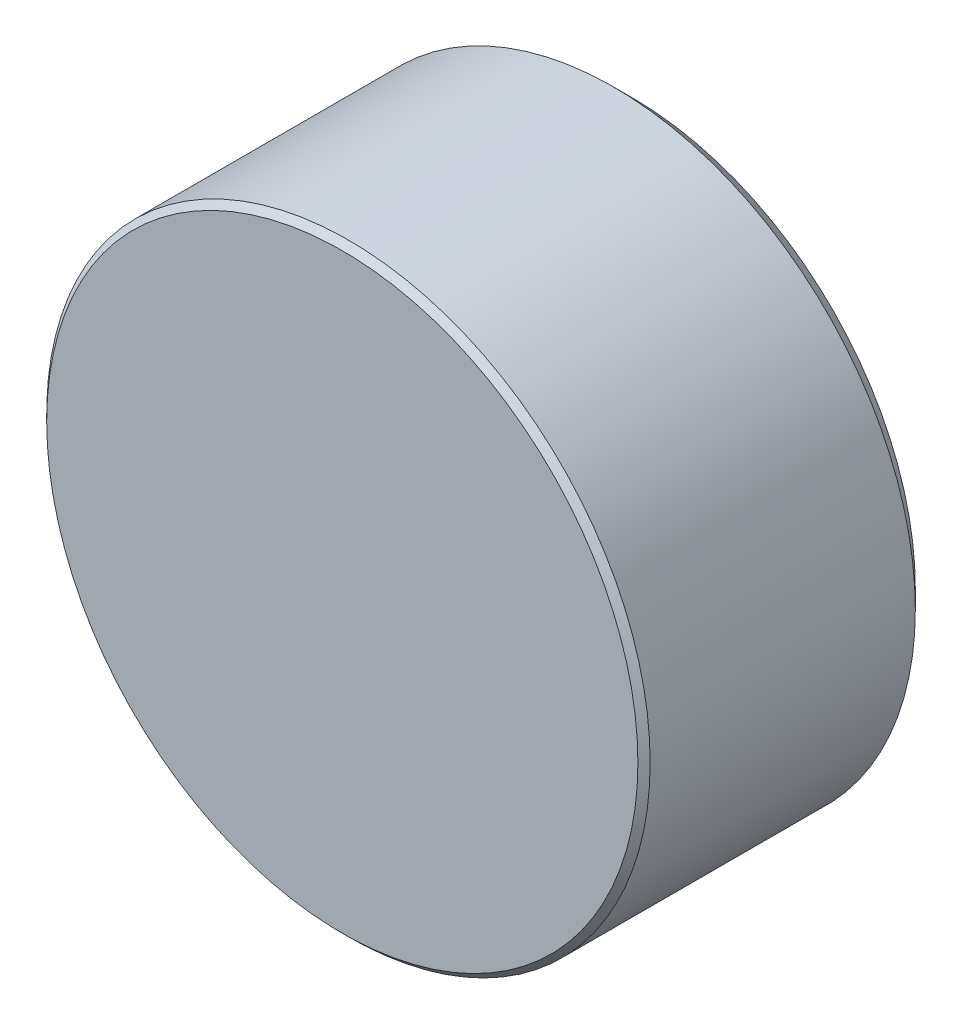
ISO-10303-21;
HEADER;
FILE_DESCRIPTION(('STEP AP214'),'2;1');
FILE_NAME('part.step','',(''),(''),'','','');
FILE_SCHEMA(('AUTOMOTIVE_DESIGN { 1 0 10303 214 1 1 1 1 }'));
ENDSEC;
DATA;
#1=APPLICATION_CONTEXT('core data for automotive mechanical design processes');
#2=APPLICATION_PROTOCOL_DEFINITION('international standard','automotive_design',2000,#1);
#3=PRODUCT_CONTEXT('',#1,'mechanical');
#4=PRODUCT('Part','Part','',(#3));
#5=PRODUCT_RELATED_PRODUCT_CATEGORY('part','',(#4));
#6=PRODUCT_DEFINITION_FORMATION('','',#4);
#7=PRODUCT_DEFINITION_CONTEXT('part definition',#1,'design');
#8=PRODUCT_DEFINITION('design','',#6,#7);
#9=PRODUCT_DEFINITION_SHAPE('','',#8);
#10=(LENGTH_UNIT() NAMED_UNIT(*) SI_UNIT(.MILLI.,.METRE.));
#11=(NAMED_UNIT(*) PLANE_ANGLE_UNIT() SI_UNIT($,.RADIAN.));
#12=(NAMED_UNIT(*) SI_UNIT($,.STERADIAN.) SOLID_ANGLE_UNIT());
#13=UNCERTAINTY_MEASURE_WITH_UNIT(LENGTH_MEASURE(1.E-05),#10,'distance_accuracy_value','');
#14=(GEOMETRIC_REPRESENTATION_CONTEXT(3) GLOBAL_UNCERTAINTY_ASSIGNED_CONTEXT((#13)) GLOBAL_UNIT_ASSIGNED_CONTEXT((#10,
#11,#12)) REPRESENTATION_CONTEXT('',''));
#15=CARTESIAN_POINT('',(0.,0.,0.));
#16=DIRECTION('',(0.,0.,1.));
#17=DIRECTION('',(1.,0.,0.));
#18=AXIS2_PLACEMENT_3D('',#15,#16,#17);
#19=CARTESIAN_POINT('',(0.,0.,0.));
#20=DIRECTION('',(0.,0.,1.));
#21=DIRECTION('',(1.,0.,0.));
#22=AXIS2_PLACEMENT_3D('',#19,#20,#21);
#23=PLANE('',#22);
#24=CARTESIAN_POINT('',(0.,0.,0.));
#25=DIRECTION('',(0.,0.,-1.));
#26=DIRECTION('',(-1.,0.,0.));
#27=AXIS2_PLACEMENT_3D('',#24,#25,#26);
#28=CIRCLE('',#27,3.);
#29=CARTESIAN_POINT('',(-3.,0.,0.));
#30=VERTEX_POINT('',#29);
#31=EDGE_CURVE('E33',#30,#30,#28,.T.);
#32=ORIENTED_EDGE('',*,*,#31,.F.);
#33=EDGE_LOOP('',(#32));
#34=FACE_BOUND('',#33,.T.);
#35=CARTESIAN_POINT('',(0.,0.,0.));
#36=DIRECTION('',(0.,0.,1.));
#37=DIRECTION('',(1.,0.,0.));
#38=AXIS2_PLACEMENT_3D('',#35,#36,#37);
#39=CIRCLE('',#38,11.738);
#40=CARTESIAN_POINT('',(11.738,0.,0.));
#41=VERTEX_POINT('',#40);
#42=EDGE_CURVE('E23',#41,#41,#39,.F.);
#43=ORIENTED_EDGE('',*,*,#42,.T.);
#44=EDGE_LOOP('',(#43));
#45=FACE_BOUND('',#44,.T.);
#46=ADVANCED_FACE('F12',(#34,#45),#23,.F.);
#47=CARTESIAN_POINT('',(0.,0.,12.));
#48=DIRECTION('',(0.,0.,-1.));
#49=DIRECTION('',(-1.,0.,0.));
#50=AXIS2_PLACEMENT_3D('',#47,#48,#49);
#51=CYLINDRICAL_SURFACE('',#50,12.5);
#52=CARTESIAN_POINT('',(0.,0.,11.746));
#53=DIRECTION('',(0.,0.,1.));
#54=DIRECTION('',(1.,0.,0.));
#55=AXIS2_PLACEMENT_3D('',#52,#53,#54);
#56=CIRCLE('',#55,12.5);
#57=CARTESIAN_POINT('',(12.5,0.,11.746));
#58=VERTEX_POINT('',#57);
#59=EDGE_CURVE('E8',#58,#58,#56,.F.);
#60=ORIENTED_EDGE('',*,*,#59,.T.);
#61=EDGE_LOOP('',(#60));
#62=FACE_BOUND('',#61,.T.);
#63=CARTESIAN_POINT('',(0.,0.,0.762));
#64=DIRECTION('',(0.,0.,1.));
#65=DIRECTION('',(1.,0.,0.));
#66=AXIS2_PLACEMENT_3D('',#63,#64,#65);
#67=CIRCLE('',#66,12.5);
#68=CARTESIAN_POINT('',(12.5,0.,0.762));
#69=VERTEX_POINT('',#68);
#70=EDGE_CURVE('E27',#69,#69,#67,.T.);
#71=ORIENTED_EDGE('',*,*,#70,.T.);
#72=EDGE_LOOP('',(#71));
#73=FACE_BOUND('',#72,.T.);
#74=ADVANCED_FACE('F49',(#62,#73),#51,.T.);
#75=CARTESIAN_POINT('',(0.,0.,12.));
#76=DIRECTION('',(0.,0.,1.));
#77=DIRECTION('',(1.,0.,0.));
#78=AXIS2_PLACEMENT_3D('',#75,#76,#77);
#79=PLANE('',#78);
#80=CARTESIAN_POINT('',(0.,0.,12.));
#81=DIRECTION('',(0.,0.,1.));
#82=DIRECTION('',(1.,0.,0.));
#83=AXIS2_PLACEMENT_3D('',#80,#81,#82);
#84=CIRCLE('',#83,12.246);
#85=CARTESIAN_POINT('',(12.246,0.,12.));
#86=VERTEX_POINT('',#85);
#87=EDGE_CURVE('E19',#86,#86,#84,.T.);
#88=ORIENTED_EDGE('',*,*,#87,.T.);
#89=EDGE_LOOP('',(#88));
#90=FACE_BOUND('',#89,.T.);
#91=ADVANCED_FACE('F56',(#90),#79,.T.);
#92=CARTESIAN_POINT('',(0.,0.,0.762));
#93=DIRECTION('',(0.,0.,1.));
#94=DIRECTION('',(1.,0.,0.));
#95=AXIS2_PLACEMENT_3D('',#92,#93,#94);
#96=CONICAL_SURFACE('',#95,12.5,0.78539816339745);
#97=ORIENTED_EDGE('',*,*,#42,.F.);
#98=EDGE_LOOP('',(#97));
#99=FACE_BOUND('',#98,.T.);
#100=ORIENTED_EDGE('',*,*,#70,.F.);
#101=EDGE_LOOP('',(#100));
#102=FACE_BOUND('',#101,.T.);
#103=ADVANCED_FACE('F53',(#99,#102),#96,.T.);
#104=CARTESIAN_POINT('',(0.,0.,12.));
#105=DIRECTION('',(0.,0.,-1.));
#106=DIRECTION('',(-1.,0.,0.));
#107=AXIS2_PLACEMENT_3D('',#104,#105,#106);
#108=CONICAL_SURFACE('',#107,12.246,0.785398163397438);
#109=ORIENTED_EDGE('',*,*,#59,.F.);
#110=EDGE_LOOP('',(#109));
#111=FACE_BOUND('',#110,.T.);
#112=ORIENTED_EDGE('',*,*,#87,.F.);
#113=EDGE_LOOP('',(#112));
#114=FACE_BOUND('',#113,.T.);
#115=ADVANCED_FACE('F14',(#111,#114),#108,.T.);
#116=CARTESIAN_POINT('',(0.,0.,6.4));
#117=DIRECTION('',(0.,0.,-1.));
#118=DIRECTION('',(-1.,0.,0.));
#119=AXIS2_PLACEMENT_3D('',#116,#117,#118);
#120=CYLINDRICAL_SURFACE('',#119,3.);
#121=CARTESIAN_POINT('',(0.,0.,6.4));
#122=DIRECTION('',(0.,0.,-1.));
#123=DIRECTION('',(-1.,0.,0.));
#124=AXIS2_PLACEMENT_3D('',#121,#122,#123);
#125=CIRCLE('',#124,3.);
#126=CARTESIAN_POINT('',(-3.,0.,6.4));
#127=VERTEX_POINT('',#126);
#128=EDGE_CURVE('E32',#127,#127,#125,.T.);
#129=ORIENTED_EDGE('',*,*,#128,.F.);
#130=EDGE_LOOP('',(#129));
#131=FACE_BOUND('',#130,.T.);
#132=ORIENTED_EDGE('',*,*,#31,.T.);
#133=EDGE_LOOP('',(#132));
#134=FACE_BOUND('',#133,.T.);
#135=ADVANCED_FACE('F41',(#131,#134),#120,.F.);
#136=CARTESIAN_POINT('',(0.,0.,6.4));
#137=DIRECTION('',(0.,0.,-1.));
#138=DIRECTION('',(-1.,0.,0.));
#139=AXIS2_PLACEMENT_3D('',#136,#137,#138);
#140=PLANE('',#139);
#141=ORIENTED_EDGE('',*,*,#128,.T.);
#142=EDGE_LOOP('',(#141));
#143=FACE_BOUND('',#142,.T.);
#144=ADVANCED_FACE('F39',(#143),#140,.T.);
#145=CLOSED_SHELL('',(#46,#74,#91,#103,#115,#135,#144));
#146=MANIFOLD_SOLID_BREP('B1',#145);
#147=ADVANCED_BREP_SHAPE_REPRESENTATION('',(#18,#146),#14);
#148=SHAPE_DEFINITION_REPRESENTATION(#9,#147);
ENDSEC;
END-ISO-10303-21;
